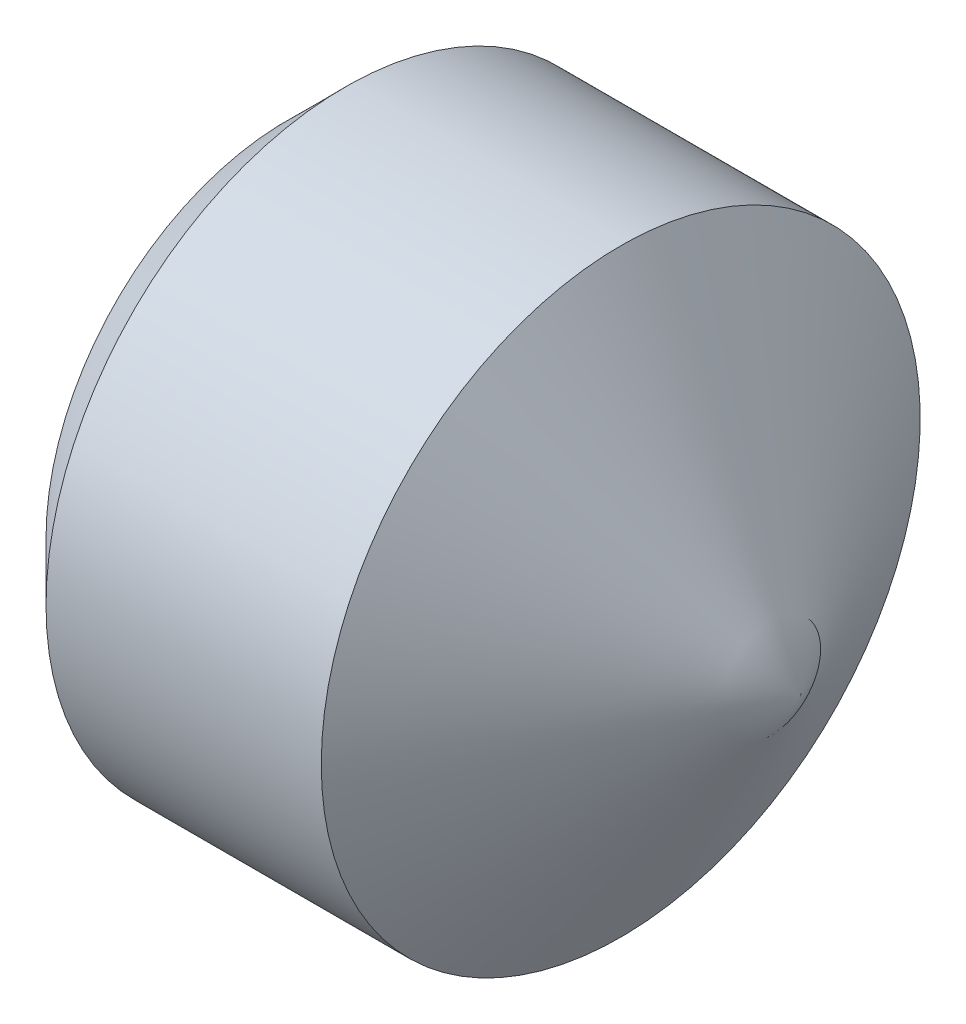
from build123d import *

# Parameters (mm, degrees)
HEX_2_DEPTH = 5.5626


with BuildPart() as part:
    # BodySke → BaseBody (revolve)
    with BuildSketch(Plane.XY, mode=Mode.PRIVATE) as basebody_sk:
        Polygon((0, 0), (0, 4.47675), (1.0795, 5.55625), (6.186468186, 5.55625), (9.525, 0), align=None)
    revolve(basebody_sk.sketch.rotate(Axis((-12.7, 0, 0), (1, 0, 0)), 90), axis=Axis((-12.7, 0, 0), (1, 0, 0)))

    # Sketch2 → Hex 2 (cut)
    with BuildSketch(Plane.ZY):
        Polygon((1.603584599, 2.77749), (-1.603584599, 2.77749), (-3.207169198, 0), (-1.603584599, -2.77749), (1.603584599, -2.77749), (3.207169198, 0), align=None)
    extrude(amount=-HEX_2_DEPTH, mode=Mode.SUBTRACT)


solid = part.part
